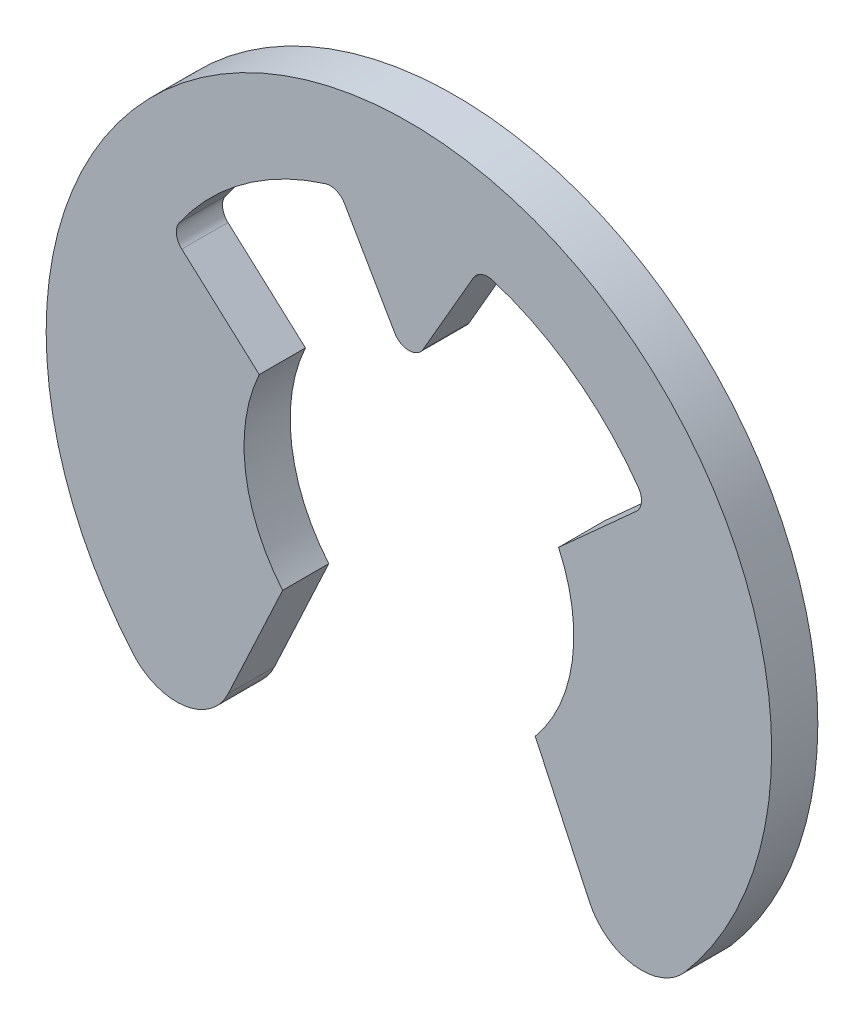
ISO-10303-21;
HEADER;
FILE_DESCRIPTION(('STEP AP214'),'2;1');
FILE_NAME('part.step','',(''),(''),'','','');
FILE_SCHEMA(('AUTOMOTIVE_DESIGN { 1 0 10303 214 1 1 1 1 }'));
ENDSEC;
DATA;
#1=APPLICATION_CONTEXT('core data for automotive mechanical design processes');
#2=APPLICATION_PROTOCOL_DEFINITION('international standard','automotive_design',2000,#1);
#3=PRODUCT_CONTEXT('',#1,'mechanical');
#4=PRODUCT('Part','Part','',(#3));
#5=PRODUCT_RELATED_PRODUCT_CATEGORY('part','',(#4));
#6=PRODUCT_DEFINITION_FORMATION('','',#4);
#7=PRODUCT_DEFINITION_CONTEXT('part definition',#1,'design');
#8=PRODUCT_DEFINITION('design','',#6,#7);
#9=PRODUCT_DEFINITION_SHAPE('','',#8);
#10=(LENGTH_UNIT() NAMED_UNIT(*) SI_UNIT(.MILLI.,.METRE.));
#11=(NAMED_UNIT(*) PLANE_ANGLE_UNIT() SI_UNIT($,.RADIAN.));
#12=(NAMED_UNIT(*) SI_UNIT($,.STERADIAN.) SOLID_ANGLE_UNIT());
#13=UNCERTAINTY_MEASURE_WITH_UNIT(LENGTH_MEASURE(1.E-05),#10,'distance_accuracy_value','');
#14=(GEOMETRIC_REPRESENTATION_CONTEXT(3) GLOBAL_UNCERTAINTY_ASSIGNED_CONTEXT((#13)) GLOBAL_UNIT_ASSIGNED_CONTEXT((#10,
#11,#12)) REPRESENTATION_CONTEXT('',''));
#15=CARTESIAN_POINT('',(0.,0.,0.));
#16=DIRECTION('',(0.,0.,1.));
#17=DIRECTION('',(1.,0.,0.));
#18=AXIS2_PLACEMENT_3D('',#15,#16,#17);
#19=CARTESIAN_POINT('',(1.19378964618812,3.81770432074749,0.7));
#20=DIRECTION('',(0.,0.,1.));
#21=DIRECTION('',(1.,0.,0.));
#22=AXIS2_PLACEMENT_3D('',#19,#20,#21);
#23=PLANE('',#22);
#24=CARTESIAN_POINT('',(0.,2.75,0.7));
#25=DIRECTION('',(0.,0.,-1.));
#26=DIRECTION('',(-1.,0.,0.));
#27=AXIS2_PLACEMENT_3D('',#24,#25,#26);
#28=CIRCLE('',#27,0.25);
#29=CARTESIAN_POINT('',(-0.216506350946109,2.625,0.7));
#30=VERTEX_POINT('',#29);
#31=CARTESIAN_POINT('',(0.216506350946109,2.625,0.7));
#32=VERTEX_POINT('',#31);
#33=EDGE_CURVE('E141',#30,#32,#28,.F.);
#34=ORIENTED_EDGE('',*,*,#33,.T.);
#35=DIRECTION('',(0.500000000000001,0.866025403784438,0.));
#36=VECTOR('',#35,1.);
#37=CARTESIAN_POINT('',(0.216506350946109,2.625,0.7));
#38=LINE('',#37,#36);
#39=CARTESIAN_POINT('',(0.977283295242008,3.94270432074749,0.7));
#40=VERTEX_POINT('',#39);
#41=EDGE_CURVE('E138',#32,#40,#38,.T.);
#42=ORIENTED_EDGE('',*,*,#41,.T.);
#43=CARTESIAN_POINT('',(1.19378964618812,3.81770432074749,0.7));
#44=DIRECTION('',(0.,0.,-1.));
#45=DIRECTION('',(-1.,0.,0.));
#46=AXIS2_PLACEMENT_3D('',#43,#44,#45);
#47=CIRCLE('',#46,0.250000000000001);
#48=CARTESIAN_POINT('',(1.26840149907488,4.05631084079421,0.7));
#49=VERTEX_POINT('',#48);
#50=EDGE_CURVE('E19',#40,#49,#47,.T.);
#51=ORIENTED_EDGE('',*,*,#50,.T.);
#52=CARTESIAN_POINT('',(0.,0.,0.7));
#53=DIRECTION('',(0.,0.,-1.));
#54=DIRECTION('',(-1.,0.,0.));
#55=AXIS2_PLACEMENT_3D('',#52,#53,#54);
#56=CIRCLE('',#55,4.25);
#57=CARTESIAN_POINT('',(3.4810551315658,2.43818686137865,0.7));
#58=VERTEX_POINT('',#57);
#59=EDGE_CURVE('E144',#49,#58,#56,.T.);
#60=ORIENTED_EDGE('',*,*,#59,.T.);
#61=CARTESIAN_POINT('',(3.27628718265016,2.29476410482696,0.7));
#62=DIRECTION('',(0.,0.,-1.));
#63=DIRECTION('',(-1.,0.,0.));
#64=AXIS2_PLACEMENT_3D('',#61,#62,#63);
#65=CIRCLE('',#64,0.250000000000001);
#66=CARTESIAN_POINT('',(3.44367977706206,2.10907695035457,0.7));
#67=VERTEX_POINT('',#66);
#68=EDGE_CURVE('E164',#58,#67,#65,.T.);
#69=ORIENTED_EDGE('',*,*,#68,.T.);
#70=DIRECTION('',(0.742748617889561,0.669570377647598,0.));
#71=VECTOR('',#70,1.);
#72=CARTESIAN_POINT('',(3.44367977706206,2.10907695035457,0.7));
#73=LINE('',#72,#71);
#74=CARTESIAN_POINT('',(2.26882339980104,1.04997160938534,0.7));
#75=VERTEX_POINT('',#74);
#76=EDGE_CURVE('E228',#67,#75,#73,.F.);
#77=ORIENTED_EDGE('',*,*,#76,.T.);
#78=CARTESIAN_POINT('',(0.,0.,0.7));
#79=DIRECTION('',(0.,0.,-1.));
#80=DIRECTION('',(-1.,0.,0.));
#81=AXIS2_PLACEMENT_3D('',#78,#79,#80);
#82=CIRCLE('',#81,2.5);
#83=CARTESIAN_POINT('',(1.91511110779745,-1.60696902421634,0.7));
#84=VERTEX_POINT('',#83);
#85=EDGE_CURVE('E167',#75,#84,#82,.T.);
#86=ORIENTED_EDGE('',*,*,#85,.T.);
#87=DIRECTION('',(-0.422618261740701,0.906307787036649,0.));
#88=VECTOR('',#87,1.);
#89=CARTESIAN_POINT('',(1.91511110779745,-1.60696902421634,0.7));
#90=LINE('',#89,#88);
#91=CARTESIAN_POINT('',(2.73972895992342,-3.37536771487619,0.7));
#92=VERTEX_POINT('',#91);
#93=EDGE_CURVE('E174',#84,#92,#90,.F.);
#94=ORIENTED_EDGE('',*,*,#93,.T.);
#95=CARTESIAN_POINT('',(3.52423493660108,-3.00954657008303,0.7));
#96=DIRECTION('',(0.,0.,-1.));
#97=DIRECTION('',(-1.,0.,0.));
#98=AXIS2_PLACEMENT_3D('',#95,#96,#97);
#99=CIRCLE('',#98,0.865606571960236);
#100=CARTESIAN_POINT('',(4.18248740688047,-3.57166615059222,0.7));
#101=VERTEX_POINT('',#100);
#102=EDGE_CURVE('E171',#101,#92,#99,.T.);
#103=ORIENTED_EDGE('',*,*,#102,.F.);
#104=CARTESIAN_POINT('',(0.,0.,0.7));
#105=DIRECTION('',(0.,0.,-1.));
#106=DIRECTION('',(-1.,0.,0.));
#107=AXIS2_PLACEMENT_3D('',#104,#105,#106);
#108=CIRCLE('',#107,5.5);
#109=CARTESIAN_POINT('',(-4.18248740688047,-3.57166615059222,0.7));
#110=VERTEX_POINT('',#109);
#111=EDGE_CURVE('E175',#110,#101,#108,.T.);
#112=ORIENTED_EDGE('',*,*,#111,.F.);
#113=CARTESIAN_POINT('',(-3.52423493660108,-3.00954657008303,0.7));
#114=DIRECTION('',(0.,0.,-1.));
#115=DIRECTION('',(-1.,0.,0.));
#116=AXIS2_PLACEMENT_3D('',#113,#114,#115);
#117=CIRCLE('',#116,0.865606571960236);
#118=CARTESIAN_POINT('',(-2.73972895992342,-3.37536771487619,0.7));
#119=VERTEX_POINT('',#118);
#120=EDGE_CURVE('E177',#119,#110,#117,.T.);
#121=ORIENTED_EDGE('',*,*,#120,.F.);
#122=DIRECTION('',(0.422618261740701,0.906307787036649,0.));
#123=VECTOR('',#122,1.);
#124=CARTESIAN_POINT('',(-1.91511110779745,-1.60696902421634,0.7));
#125=LINE('',#124,#123);
#126=CARTESIAN_POINT('',(-1.91511110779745,-1.60696902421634,0.7));
#127=VERTEX_POINT('',#126);
#128=EDGE_CURVE('E232',#127,#119,#125,.F.);
#129=ORIENTED_EDGE('',*,*,#128,.F.);
#130=CARTESIAN_POINT('',(0.,0.,0.7));
#131=DIRECTION('',(0.,0.,-1.));
#132=DIRECTION('',(-1.,0.,0.));
#133=AXIS2_PLACEMENT_3D('',#130,#131,#132);
#134=CIRCLE('',#133,2.5);
#135=CARTESIAN_POINT('',(-2.26882339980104,1.04997160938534,0.7));
#136=VERTEX_POINT('',#135);
#137=EDGE_CURVE('E181',#127,#136,#134,.T.);
#138=ORIENTED_EDGE('',*,*,#137,.T.);
#139=DIRECTION('',(-0.742748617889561,0.669570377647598,0.));
#140=VECTOR('',#139,1.);
#141=CARTESIAN_POINT('',(-3.44367977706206,2.10907695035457,0.7));
#142=LINE('',#141,#140);
#143=CARTESIAN_POINT('',(-3.44367977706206,2.10907695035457,0.7));
#144=VERTEX_POINT('',#143);
#145=EDGE_CURVE('E184',#144,#136,#142,.F.);
#146=ORIENTED_EDGE('',*,*,#145,.F.);
#147=CARTESIAN_POINT('',(-3.27628718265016,2.29476410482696,0.7));
#148=DIRECTION('',(0.,0.,-1.));
#149=DIRECTION('',(-1.,0.,0.));
#150=AXIS2_PLACEMENT_3D('',#147,#148,#149);
#151=CIRCLE('',#150,0.250000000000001);
#152=CARTESIAN_POINT('',(-3.4810551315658,2.43818686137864,0.7));
#153=VERTEX_POINT('',#152);
#154=EDGE_CURVE('E186',#144,#153,#151,.T.);
#155=ORIENTED_EDGE('',*,*,#154,.T.);
#156=CARTESIAN_POINT('',(0.,0.,0.7));
#157=DIRECTION('',(0.,0.,-1.));
#158=DIRECTION('',(-1.,0.,0.));
#159=AXIS2_PLACEMENT_3D('',#156,#157,#158);
#160=CIRCLE('',#159,4.25);
#161=CARTESIAN_POINT('',(-1.26840149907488,4.05631084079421,0.7));
#162=VERTEX_POINT('',#161);
#163=EDGE_CURVE('E190',#153,#162,#160,.T.);
#164=ORIENTED_EDGE('',*,*,#163,.T.);
#165=CARTESIAN_POINT('',(-1.19378964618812,3.81770432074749,0.7));
#166=DIRECTION('',(0.,0.,-1.));
#167=DIRECTION('',(-1.,0.,0.));
#168=AXIS2_PLACEMENT_3D('',#165,#166,#167);
#169=CIRCLE('',#168,0.250000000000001);
#170=CARTESIAN_POINT('',(-0.977283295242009,3.94270432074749,0.7));
#171=VERTEX_POINT('',#170);
#172=EDGE_CURVE('E155',#162,#171,#169,.T.);
#173=ORIENTED_EDGE('',*,*,#172,.T.);
#174=DIRECTION('',(0.500000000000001,-0.866025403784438,0.));
#175=VECTOR('',#174,1.);
#176=CARTESIAN_POINT('',(-0.977283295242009,3.94270432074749,0.7));
#177=LINE('',#176,#175);
#178=EDGE_CURVE('E156',#171,#30,#177,.T.);
#179=ORIENTED_EDGE('',*,*,#178,.T.);
#180=EDGE_LOOP('',(#34,#42,#51,#60,#69,#77,#86,#94,#103,#112,#121,#129,#138,#146,#155,#164,#173,#179));
#181=FACE_BOUND('',#180,.T.);
#182=ADVANCED_FACE('F15',(#181),#23,.T.);
#183=CARTESIAN_POINT('',(0.,0.,0.7));
#184=DIRECTION('',(0.,0.,-1.));
#185=DIRECTION('',(-1.,0.,0.));
#186=AXIS2_PLACEMENT_3D('',#183,#184,#185);
#187=CYLINDRICAL_SURFACE('',#186,4.25);
#188=DIRECTION('',(0.,0.,-1.));
#189=VECTOR('',#188,1.);
#190=CARTESIAN_POINT('',(3.4810551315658,2.43818686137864,0.7));
#191=LINE('',#190,#189);
#192=CARTESIAN_POINT('',(3.4810551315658,2.43818686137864,0.));
#193=VERTEX_POINT('',#192);
#194=EDGE_CURVE('E163',#193,#58,#191,.F.);
#195=ORIENTED_EDGE('',*,*,#194,.T.);
#196=ORIENTED_EDGE('',*,*,#59,.F.);
#197=DIRECTION('',(0.,0.,-1.));
#198=VECTOR('',#197,1.);
#199=CARTESIAN_POINT('',(1.26840149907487,4.05631084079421,0.7));
#200=LINE('',#199,#198);
#201=CARTESIAN_POINT('',(1.26840149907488,4.05631084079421,0.));
#202=VERTEX_POINT('',#201);
#203=EDGE_CURVE('E149',#49,#202,#200,.T.);
#204=ORIENTED_EDGE('',*,*,#203,.T.);
#205=CARTESIAN_POINT('',(0.,0.,0.));
#206=DIRECTION('',(0.,0.,-1.));
#207=DIRECTION('',(-1.,0.,0.));
#208=AXIS2_PLACEMENT_3D('',#205,#206,#207);
#209=CIRCLE('',#208,4.25);
#210=EDGE_CURVE('E193',#202,#193,#209,.T.);
#211=ORIENTED_EDGE('',*,*,#210,.T.);
#212=EDGE_LOOP('',(#195,#196,#204,#211));
#213=FACE_BOUND('',#212,.T.);
#214=ADVANCED_FACE('F337',(#213),#187,.F.);
#215=CARTESIAN_POINT('',(3.27628718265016,2.29476410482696,0.7));
#216=DIRECTION('',(0.,0.,-1.));
#217=DIRECTION('',(-1.,0.,0.));
#218=AXIS2_PLACEMENT_3D('',#215,#216,#217);
#219=CYLINDRICAL_SURFACE('',#218,0.250000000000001);
#220=DIRECTION('',(0.,0.,1.));
#221=VECTOR('',#220,1.);
#222=CARTESIAN_POINT('',(3.44367977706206,2.10907695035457,0.7));
#223=LINE('',#222,#221);
#224=CARTESIAN_POINT('',(3.44367977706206,2.10907695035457,0.));
#225=VERTEX_POINT('',#224);
#226=EDGE_CURVE('E166',#225,#67,#223,.T.);
#227=ORIENTED_EDGE('',*,*,#226,.T.);
#228=ORIENTED_EDGE('',*,*,#68,.F.);
#229=ORIENTED_EDGE('',*,*,#194,.F.);
#230=CARTESIAN_POINT('',(3.27628718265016,2.29476410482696,0.));
#231=DIRECTION('',(0.,0.,-1.));
#232=DIRECTION('',(-1.,0.,0.));
#233=AXIS2_PLACEMENT_3D('',#230,#231,#232);
#234=CIRCLE('',#233,0.250000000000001);
#235=EDGE_CURVE('E196',#193,#225,#234,.T.);
#236=ORIENTED_EDGE('',*,*,#235,.T.);
#237=EDGE_LOOP('',(#227,#228,#229,#236));
#238=FACE_BOUND('',#237,.T.);
#239=ADVANCED_FACE('F334',(#238),#219,.F.);
#240=CARTESIAN_POINT('',(3.44367977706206,2.10907695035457,0.7));
#241=DIRECTION('',(0.669570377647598,-0.742748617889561,0.));
#242=DIRECTION('',(0.742748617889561,0.669570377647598,0.));
#243=AXIS2_PLACEMENT_3D('',#240,#241,#242);
#244=PLANE('',#243);
#245=DIRECTION('',(0.,0.,-1.));
#246=VECTOR('',#245,1.);
#247=CARTESIAN_POINT('',(2.26882339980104,1.04997160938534,0.7));
#248=LINE('',#247,#246);
#249=CARTESIAN_POINT('',(2.26882339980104,1.04997160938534,0.));
#250=VERTEX_POINT('',#249);
#251=EDGE_CURVE('E170',#250,#75,#248,.F.);
#252=ORIENTED_EDGE('',*,*,#251,.T.);
#253=ORIENTED_EDGE('',*,*,#76,.F.);
#254=ORIENTED_EDGE('',*,*,#226,.F.);
#255=DIRECTION('',(-0.74274861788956,-0.669570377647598,0.));
#256=VECTOR('',#255,1.);
#257=CARTESIAN_POINT('',(3.44367977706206,2.10907695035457,0.));
#258=LINE('',#257,#256);
#259=EDGE_CURVE('E199',#225,#250,#258,.T.);
#260=ORIENTED_EDGE('',*,*,#259,.T.);
#261=EDGE_LOOP('',(#252,#253,#254,#260));
#262=FACE_BOUND('',#261,.T.);
#263=ADVANCED_FACE('F331',(#262),#244,.F.);
#264=CARTESIAN_POINT('',(0.,0.,0.7));
#265=DIRECTION('',(0.,0.,-1.));
#266=DIRECTION('',(-1.,0.,0.));
#267=AXIS2_PLACEMENT_3D('',#264,#265,#266);
#268=CYLINDRICAL_SURFACE('',#267,2.5);
#269=DIRECTION('',(0.,0.,1.));
#270=VECTOR('',#269,1.);
#271=CARTESIAN_POINT('',(1.91511110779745,-1.60696902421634,0.7));
#272=LINE('',#271,#270);
#273=CARTESIAN_POINT('',(1.91511110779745,-1.60696902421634,0.));
#274=VERTEX_POINT('',#273);
#275=EDGE_CURVE('E169',#274,#84,#272,.T.);
#276=ORIENTED_EDGE('',*,*,#275,.T.);
#277=ORIENTED_EDGE('',*,*,#85,.F.);
#278=ORIENTED_EDGE('',*,*,#251,.F.);
#279=CARTESIAN_POINT('',(0.,0.,0.));
#280=DIRECTION('',(0.,0.,-1.));
#281=DIRECTION('',(-1.,0.,0.));
#282=AXIS2_PLACEMENT_3D('',#279,#280,#281);
#283=CIRCLE('',#282,2.5);
#284=EDGE_CURVE('E200',#250,#274,#283,.T.);
#285=ORIENTED_EDGE('',*,*,#284,.T.);
#286=EDGE_LOOP('',(#276,#277,#278,#285));
#287=FACE_BOUND('',#286,.T.);
#288=ADVANCED_FACE('F327',(#287),#268,.F.);
#289=CARTESIAN_POINT('',(1.91511110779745,-1.60696902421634,0.7));
#290=DIRECTION('',(0.906307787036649,0.422618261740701,0.));
#291=DIRECTION('',(-0.422618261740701,0.906307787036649,0.));
#292=AXIS2_PLACEMENT_3D('',#289,#290,#291);
#293=PLANE('',#292);
#294=DIRECTION('',(0.,0.,-1.));
#295=VECTOR('',#294,1.);
#296=CARTESIAN_POINT('',(2.73972895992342,-3.37536771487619,0.7));
#297=LINE('',#296,#295);
#298=CARTESIAN_POINT('',(2.73972895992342,-3.37536771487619,0.));
#299=VERTEX_POINT('',#298);
#300=EDGE_CURVE('E173',#92,#299,#297,.T.);
#301=ORIENTED_EDGE('',*,*,#300,.F.);
#302=ORIENTED_EDGE('',*,*,#93,.F.);
#303=ORIENTED_EDGE('',*,*,#275,.F.);
#304=DIRECTION('',(0.422618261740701,-0.906307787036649,0.));
#305=VECTOR('',#304,1.);
#306=CARTESIAN_POINT('',(1.91511110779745,-1.60696902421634,0.));
#307=LINE('',#306,#305);
#308=EDGE_CURVE('E203',#274,#299,#307,.T.);
#309=ORIENTED_EDGE('',*,*,#308,.T.);
#310=EDGE_LOOP('',(#301,#302,#303,#309));
#311=FACE_BOUND('',#310,.T.);
#312=ADVANCED_FACE('F323',(#311),#293,.F.);
#313=CARTESIAN_POINT('',(3.52423493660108,-3.00954657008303,0.7));
#314=DIRECTION('',(0.,0.,-1.));
#315=DIRECTION('',(-1.,0.,0.));
#316=AXIS2_PLACEMENT_3D('',#313,#314,#315);
#317=CYLINDRICAL_SURFACE('',#316,0.865606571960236);
#318=ORIENTED_EDGE('',*,*,#102,.T.);
#319=ORIENTED_EDGE('',*,*,#300,.T.);
#320=CARTESIAN_POINT('',(3.52423493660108,-3.00954657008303,0.));
#321=DIRECTION('',(0.,0.,-1.));
#322=DIRECTION('',(-1.,0.,0.));
#323=AXIS2_PLACEMENT_3D('',#320,#321,#322);
#324=CIRCLE('',#323,0.865606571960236);
#325=CARTESIAN_POINT('',(4.18248740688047,-3.57166615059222,0.));
#326=VERTEX_POINT('',#325);
#327=EDGE_CURVE('E204',#299,#326,#324,.F.);
#328=ORIENTED_EDGE('',*,*,#327,.T.);
#329=DIRECTION('',(0.,0.,-1.));
#330=VECTOR('',#329,1.);
#331=CARTESIAN_POINT('',(4.18248740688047,-3.57166615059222,0.7));
#332=LINE('',#331,#330);
#333=EDGE_CURVE('E178',#101,#326,#332,.T.);
#334=ORIENTED_EDGE('',*,*,#333,.F.);
#335=EDGE_LOOP('',(#318,#319,#328,#334));
#336=FACE_BOUND('',#335,.T.);
#337=ADVANCED_FACE('F318',(#336),#317,.T.);
#338=CARTESIAN_POINT('',(0.,0.,0.7));
#339=DIRECTION('',(0.,0.,-1.));
#340=DIRECTION('',(-1.,0.,0.));
#341=AXIS2_PLACEMENT_3D('',#338,#339,#340);
#342=CYLINDRICAL_SURFACE('',#341,5.5);
#343=CARTESIAN_POINT('',(0.,0.,0.));
#344=DIRECTION('',(0.,0.,-1.));
#345=DIRECTION('',(-1.,0.,0.));
#346=AXIS2_PLACEMENT_3D('',#343,#344,#345);
#347=CIRCLE('',#346,5.5);
#348=CARTESIAN_POINT('',(-4.18248740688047,-3.57166615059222,0.));
#349=VERTEX_POINT('',#348);
#350=EDGE_CURVE('E207',#326,#349,#347,.F.);
#351=ORIENTED_EDGE('',*,*,#350,.T.);
#352=DIRECTION('',(0.,0.,-1.));
#353=VECTOR('',#352,1.);
#354=CARTESIAN_POINT('',(-4.18248740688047,-3.57166615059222,0.7));
#355=LINE('',#354,#353);
#356=EDGE_CURVE('E180',#110,#349,#355,.T.);
#357=ORIENTED_EDGE('',*,*,#356,.F.);
#358=ORIENTED_EDGE('',*,*,#111,.T.);
#359=ORIENTED_EDGE('',*,*,#333,.T.);
#360=EDGE_LOOP('',(#351,#357,#358,#359));
#361=FACE_BOUND('',#360,.T.);
#362=ADVANCED_FACE('F416',(#361),#342,.T.);
#363=CARTESIAN_POINT('',(-3.52423493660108,-3.00954657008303,0.7));
#364=DIRECTION('',(0.,0.,-1.));
#365=DIRECTION('',(-1.,0.,0.));
#366=AXIS2_PLACEMENT_3D('',#363,#364,#365);
#367=CYLINDRICAL_SURFACE('',#366,0.865606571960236);
#368=ORIENTED_EDGE('',*,*,#120,.T.);
#369=ORIENTED_EDGE('',*,*,#356,.T.);
#370=CARTESIAN_POINT('',(-3.52423493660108,-3.00954657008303,0.));
#371=DIRECTION('',(0.,0.,-1.));
#372=DIRECTION('',(-1.,0.,0.));
#373=AXIS2_PLACEMENT_3D('',#370,#371,#372);
#374=CIRCLE('',#373,0.865606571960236);
#375=CARTESIAN_POINT('',(-2.73972895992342,-3.37536771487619,0.));
#376=VERTEX_POINT('',#375);
#377=EDGE_CURVE('E209',#349,#376,#374,.F.);
#378=ORIENTED_EDGE('',*,*,#377,.T.);
#379=DIRECTION('',(0.,0.,1.));
#380=VECTOR('',#379,1.);
#381=CARTESIAN_POINT('',(-2.73972895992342,-3.37536771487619,0.7));
#382=LINE('',#381,#380);
#383=EDGE_CURVE('E234',#119,#376,#382,.F.);
#384=ORIENTED_EDGE('',*,*,#383,.F.);
#385=EDGE_LOOP('',(#368,#369,#378,#384));
#386=FACE_BOUND('',#385,.T.);
#387=ADVANCED_FACE('F309',(#386),#367,.T.);
#388=CARTESIAN_POINT('',(-1.91511110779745,-1.60696902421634,0.7));
#389=DIRECTION('',(0.906307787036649,-0.422618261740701,0.));
#390=DIRECTION('',(0.422618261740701,0.906307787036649,0.));
#391=AXIS2_PLACEMENT_3D('',#388,#389,#390);
#392=PLANE('',#391);
#393=ORIENTED_EDGE('',*,*,#128,.T.);
#394=ORIENTED_EDGE('',*,*,#383,.T.);
#395=DIRECTION('',(0.422618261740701,0.906307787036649,0.));
#396=VECTOR('',#395,1.);
#397=CARTESIAN_POINT('',(-2.73972895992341,-3.37536771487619,0.));
#398=LINE('',#397,#396);
#399=CARTESIAN_POINT('',(-1.91511110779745,-1.60696902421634,0.));
#400=VERTEX_POINT('',#399);
#401=EDGE_CURVE('E212',#376,#400,#398,.T.);
#402=ORIENTED_EDGE('',*,*,#401,.T.);
#403=DIRECTION('',(0.,0.,-1.));
#404=VECTOR('',#403,1.);
#405=CARTESIAN_POINT('',(-1.91511110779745,-1.60696902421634,0.7));
#406=LINE('',#405,#404);
#407=EDGE_CURVE('E185',#400,#127,#406,.F.);
#408=ORIENTED_EDGE('',*,*,#407,.T.);
#409=EDGE_LOOP('',(#393,#394,#402,#408));
#410=FACE_BOUND('',#409,.T.);
#411=ADVANCED_FACE('F305',(#410),#392,.T.);
#412=CARTESIAN_POINT('',(0.,0.,0.7));
#413=DIRECTION('',(0.,0.,-1.));
#414=DIRECTION('',(-1.,0.,0.));
#415=AXIS2_PLACEMENT_3D('',#412,#413,#414);
#416=CYLINDRICAL_SURFACE('',#415,2.5);
#417=ORIENTED_EDGE('',*,*,#137,.F.);
#418=ORIENTED_EDGE('',*,*,#407,.F.);
#419=CARTESIAN_POINT('',(0.,0.,0.));
#420=DIRECTION('',(0.,0.,-1.));
#421=DIRECTION('',(-1.,0.,0.));
#422=AXIS2_PLACEMENT_3D('',#419,#420,#421);
#423=CIRCLE('',#422,2.5);
#424=CARTESIAN_POINT('',(-2.26882339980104,1.04997160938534,0.));
#425=VERTEX_POINT('',#424);
#426=EDGE_CURVE('E213',#400,#425,#423,.T.);
#427=ORIENTED_EDGE('',*,*,#426,.T.);
#428=DIRECTION('',(0.,0.,1.));
#429=VECTOR('',#428,1.);
#430=CARTESIAN_POINT('',(-2.26882339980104,1.04997160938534,0.7));
#431=LINE('',#430,#429);
#432=EDGE_CURVE('E236',#136,#425,#431,.F.);
#433=ORIENTED_EDGE('',*,*,#432,.F.);
#434=EDGE_LOOP('',(#417,#418,#427,#433));
#435=FACE_BOUND('',#434,.T.);
#436=ADVANCED_FACE('F300',(#435),#416,.F.);
#437=CARTESIAN_POINT('',(-3.44367977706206,2.10907695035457,0.7));
#438=DIRECTION('',(0.669570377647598,0.742748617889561,0.));
#439=DIRECTION('',(-0.742748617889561,0.669570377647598,0.));
#440=AXIS2_PLACEMENT_3D('',#437,#438,#439);
#441=PLANE('',#440);
#442=ORIENTED_EDGE('',*,*,#145,.T.);
#443=ORIENTED_EDGE('',*,*,#432,.T.);
#444=DIRECTION('',(-0.74274861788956,0.669570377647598,0.));
#445=VECTOR('',#444,1.);
#446=CARTESIAN_POINT('',(-2.26882339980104,1.04997160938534,0.));
#447=LINE('',#446,#445);
#448=CARTESIAN_POINT('',(-3.44367977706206,2.10907695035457,0.));
#449=VERTEX_POINT('',#448);
#450=EDGE_CURVE('E215',#425,#449,#447,.T.);
#451=ORIENTED_EDGE('',*,*,#450,.T.);
#452=DIRECTION('',(0.,0.,-1.));
#453=VECTOR('',#452,1.);
#454=CARTESIAN_POINT('',(-3.44367977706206,2.10907695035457,0.7));
#455=LINE('',#454,#453);
#456=EDGE_CURVE('E189',#449,#144,#455,.F.);
#457=ORIENTED_EDGE('',*,*,#456,.T.);
#458=EDGE_LOOP('',(#442,#443,#451,#457));
#459=FACE_BOUND('',#458,.T.);
#460=ADVANCED_FACE('F296',(#459),#441,.T.);
#461=CARTESIAN_POINT('',(-3.27628718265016,2.29476410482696,0.7));
#462=DIRECTION('',(0.,0.,-1.));
#463=DIRECTION('',(-1.,0.,0.));
#464=AXIS2_PLACEMENT_3D('',#461,#462,#463);
#465=CYLINDRICAL_SURFACE('',#464,0.250000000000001);
#466=ORIENTED_EDGE('',*,*,#154,.F.);
#467=ORIENTED_EDGE('',*,*,#456,.F.);
#468=CARTESIAN_POINT('',(-3.27628718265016,2.29476410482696,0.));
#469=DIRECTION('',(0.,0.,-1.));
#470=DIRECTION('',(-1.,0.,0.));
#471=AXIS2_PLACEMENT_3D('',#468,#469,#470);
#472=CIRCLE('',#471,0.250000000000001);
#473=CARTESIAN_POINT('',(-3.4810551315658,2.43818686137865,0.));
#474=VERTEX_POINT('',#473);
#475=EDGE_CURVE('E216',#449,#474,#472,.T.);
#476=ORIENTED_EDGE('',*,*,#475,.T.);
#477=DIRECTION('',(0.,0.,-1.));
#478=VECTOR('',#477,1.);
#479=CARTESIAN_POINT('',(-3.4810551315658,2.43818686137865,0.7));
#480=LINE('',#479,#478);
#481=EDGE_CURVE('E188',#474,#153,#480,.F.);
#482=ORIENTED_EDGE('',*,*,#481,.T.);
#483=EDGE_LOOP('',(#466,#467,#476,#482));
#484=FACE_BOUND('',#483,.T.);
#485=ADVANCED_FACE('F385',(#484),#465,.F.);
#486=CARTESIAN_POINT('',(0.,0.,0.7));
#487=DIRECTION('',(0.,0.,-1.));
#488=DIRECTION('',(-1.,0.,0.));
#489=AXIS2_PLACEMENT_3D('',#486,#487,#488);
#490=CYLINDRICAL_SURFACE('',#489,4.25);
#491=DIRECTION('',(0.,0.,-1.));
#492=VECTOR('',#491,1.);
#493=CARTESIAN_POINT('',(-1.26840149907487,4.05631084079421,0.7));
#494=LINE('',#493,#492);
#495=CARTESIAN_POINT('',(-1.26840149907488,4.05631084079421,0.));
#496=VERTEX_POINT('',#495);
#497=EDGE_CURVE('E192',#496,#162,#494,.F.);
#498=ORIENTED_EDGE('',*,*,#497,.T.);
#499=ORIENTED_EDGE('',*,*,#163,.F.);
#500=ORIENTED_EDGE('',*,*,#481,.F.);
#501=CARTESIAN_POINT('',(0.,0.,0.));
#502=DIRECTION('',(0.,0.,-1.));
#503=DIRECTION('',(-1.,0.,0.));
#504=AXIS2_PLACEMENT_3D('',#501,#502,#503);
#505=CIRCLE('',#504,4.25);
#506=EDGE_CURVE('E218',#474,#496,#505,.T.);
#507=ORIENTED_EDGE('',*,*,#506,.T.);
#508=EDGE_LOOP('',(#498,#499,#500,#507));
#509=FACE_BOUND('',#508,.T.);
#510=ADVANCED_FACE('F289',(#509),#490,.F.);
#511=CARTESIAN_POINT('',(-1.19378964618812,3.81770432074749,0.7));
#512=DIRECTION('',(0.,0.,-1.));
#513=DIRECTION('',(-1.,0.,0.));
#514=AXIS2_PLACEMENT_3D('',#511,#512,#513);
#515=CYLINDRICAL_SURFACE('',#514,0.250000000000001);
#516=DIRECTION('',(0.,0.,1.));
#517=VECTOR('',#516,1.);
#518=CARTESIAN_POINT('',(-0.977283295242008,3.94270432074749,0.7));
#519=LINE('',#518,#517);
#520=CARTESIAN_POINT('',(-0.977283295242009,3.94270432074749,0.));
#521=VERTEX_POINT('',#520);
#522=EDGE_CURVE('E260',#171,#521,#519,.F.);
#523=ORIENTED_EDGE('',*,*,#522,.F.);
#524=ORIENTED_EDGE('',*,*,#172,.F.);
#525=ORIENTED_EDGE('',*,*,#497,.F.);
#526=CARTESIAN_POINT('',(-1.19378964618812,3.81770432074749,0.));
#527=DIRECTION('',(0.,0.,-1.));
#528=DIRECTION('',(-1.,0.,0.));
#529=AXIS2_PLACEMENT_3D('',#526,#527,#528);
#530=CIRCLE('',#529,0.250000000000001);
#531=EDGE_CURVE('E221',#496,#521,#530,.T.);
#532=ORIENTED_EDGE('',*,*,#531,.T.);
#533=EDGE_LOOP('',(#523,#524,#525,#532));
#534=FACE_BOUND('',#533,.T.);
#535=ADVANCED_FACE('F286',(#534),#515,.F.);
#536=CARTESIAN_POINT('',(-0.216506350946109,2.625,0.7));
#537=DIRECTION('',(-0.866025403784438,-0.500000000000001,0.));
#538=DIRECTION('',(0.500000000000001,-0.866025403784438,0.));
#539=AXIS2_PLACEMENT_3D('',#536,#537,#538);
#540=PLANE('',#539);
#541=ORIENTED_EDGE('',*,*,#178,.F.);
#542=ORIENTED_EDGE('',*,*,#522,.T.);
#543=DIRECTION('',(0.500000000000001,-0.866025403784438,0.));
#544=VECTOR('',#543,1.);
#545=CARTESIAN_POINT('',(-0.977283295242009,3.94270432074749,0.));
#546=LINE('',#545,#544);
#547=CARTESIAN_POINT('',(-0.216506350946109,2.625,0.));
#548=VERTEX_POINT('',#547);
#549=EDGE_CURVE('E224',#521,#548,#546,.T.);
#550=ORIENTED_EDGE('',*,*,#549,.T.);
#551=DIRECTION('',(0.,0.,-1.));
#552=VECTOR('',#551,1.);
#553=CARTESIAN_POINT('',(-0.21650635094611,2.625,0.7));
#554=LINE('',#553,#552);
#555=EDGE_CURVE('E262',#30,#548,#554,.T.);
#556=ORIENTED_EDGE('',*,*,#555,.F.);
#557=EDGE_LOOP('',(#541,#542,#550,#556));
#558=FACE_BOUND('',#557,.T.);
#559=ADVANCED_FACE('F280',(#558),#540,.T.);
#560=CARTESIAN_POINT('',(0.,2.75,0.7));
#561=DIRECTION('',(0.,0.,-1.));
#562=DIRECTION('',(-1.,0.,0.));
#563=AXIS2_PLACEMENT_3D('',#560,#561,#562);
#564=CYLINDRICAL_SURFACE('',#563,0.25);
#565=ORIENTED_EDGE('',*,*,#33,.F.);
#566=ORIENTED_EDGE('',*,*,#555,.T.);
#567=CARTESIAN_POINT('',(0.,2.75,0.));
#568=DIRECTION('',(0.,0.,-1.));
#569=DIRECTION('',(-1.,0.,0.));
#570=AXIS2_PLACEMENT_3D('',#567,#568,#569);
#571=CIRCLE('',#570,0.25);
#572=CARTESIAN_POINT('',(0.216506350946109,2.625,0.));
#573=VERTEX_POINT('',#572);
#574=EDGE_CURVE('E225',#548,#573,#571,.F.);
#575=ORIENTED_EDGE('',*,*,#574,.T.);
#576=DIRECTION('',(0.,0.,1.));
#577=VECTOR('',#576,1.);
#578=CARTESIAN_POINT('',(0.216506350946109,2.625,0.7));
#579=LINE('',#578,#577);
#580=EDGE_CURVE('E150',#573,#32,#579,.T.);
#581=ORIENTED_EDGE('',*,*,#580,.T.);
#582=EDGE_LOOP('',(#565,#566,#575,#581));
#583=FACE_BOUND('',#582,.T.);
#584=ADVANCED_FACE('F339',(#583),#564,.T.);
#585=CARTESIAN_POINT('',(0.216506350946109,2.625,0.7));
#586=DIRECTION('',(-0.866025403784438,0.500000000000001,0.));
#587=DIRECTION('',(-0.500000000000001,-0.866025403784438,0.));
#588=AXIS2_PLACEMENT_3D('',#585,#586,#587);
#589=PLANE('',#588);
#590=DIRECTION('',(0.,0.,-1.));
#591=VECTOR('',#590,1.);
#592=CARTESIAN_POINT('',(0.977283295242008,3.94270432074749,0.7));
#593=LINE('',#592,#591);
#594=CARTESIAN_POINT('',(0.977283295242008,3.94270432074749,0.));
#595=VERTEX_POINT('',#594);
#596=EDGE_CURVE('E33',#595,#40,#593,.F.);
#597=ORIENTED_EDGE('',*,*,#596,.T.);
#598=ORIENTED_EDGE('',*,*,#41,.F.);
#599=ORIENTED_EDGE('',*,*,#580,.F.);
#600=DIRECTION('',(0.500000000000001,0.866025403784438,0.));
#601=VECTOR('',#600,1.);
#602=CARTESIAN_POINT('',(0.216506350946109,2.625,0.));
#603=LINE('',#602,#601);
#604=EDGE_CURVE('E25',#573,#595,#603,.T.);
#605=ORIENTED_EDGE('',*,*,#604,.T.);
#606=EDGE_LOOP('',(#597,#598,#599,#605));
#607=FACE_BOUND('',#606,.T.);
#608=ADVANCED_FACE('F147',(#607),#589,.F.);
#609=CARTESIAN_POINT('',(1.19378964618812,3.81770432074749,0.7));
#610=DIRECTION('',(0.,0.,-1.));
#611=DIRECTION('',(-1.,0.,0.));
#612=AXIS2_PLACEMENT_3D('',#609,#610,#611);
#613=CYLINDRICAL_SURFACE('',#612,0.250000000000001);
#614=ORIENTED_EDGE('',*,*,#203,.F.);
#615=ORIENTED_EDGE('',*,*,#50,.F.);
#616=ORIENTED_EDGE('',*,*,#596,.F.);
#617=CARTESIAN_POINT('',(1.19378964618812,3.81770432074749,0.));
#618=DIRECTION('',(0.,0.,-1.));
#619=DIRECTION('',(-1.,0.,0.));
#620=AXIS2_PLACEMENT_3D('',#617,#618,#619);
#621=CIRCLE('',#620,0.250000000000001);
#622=EDGE_CURVE('E10',#595,#202,#621,.T.);
#623=ORIENTED_EDGE('',*,*,#622,.T.);
#624=EDGE_LOOP('',(#614,#615,#616,#623));
#625=FACE_BOUND('',#624,.T.);
#626=ADVANCED_FACE('F153',(#625),#613,.F.);
#627=CARTESIAN_POINT('',(1.19378964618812,3.81770432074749,0.));
#628=DIRECTION('',(0.,0.,1.));
#629=DIRECTION('',(1.,0.,0.));
#630=AXIS2_PLACEMENT_3D('',#627,#628,#629);
#631=PLANE('',#630);
#632=ORIENTED_EDGE('',*,*,#604,.F.);
#633=ORIENTED_EDGE('',*,*,#574,.F.);
#634=ORIENTED_EDGE('',*,*,#549,.F.);
#635=ORIENTED_EDGE('',*,*,#531,.F.);
#636=ORIENTED_EDGE('',*,*,#506,.F.);
#637=ORIENTED_EDGE('',*,*,#475,.F.);
#638=ORIENTED_EDGE('',*,*,#450,.F.);
#639=ORIENTED_EDGE('',*,*,#426,.F.);
#640=ORIENTED_EDGE('',*,*,#401,.F.);
#641=ORIENTED_EDGE('',*,*,#377,.F.);
#642=ORIENTED_EDGE('',*,*,#350,.F.);
#643=ORIENTED_EDGE('',*,*,#327,.F.);
#644=ORIENTED_EDGE('',*,*,#308,.F.);
#645=ORIENTED_EDGE('',*,*,#284,.F.);
#646=ORIENTED_EDGE('',*,*,#259,.F.);
#647=ORIENTED_EDGE('',*,*,#235,.F.);
#648=ORIENTED_EDGE('',*,*,#210,.F.);
#649=ORIENTED_EDGE('',*,*,#622,.F.);
#650=EDGE_LOOP('',(#632,#633,#634,#635,#636,#637,#638,#639,#640,#641,#642,#643,#644,#645,#646,
#647,#648,#649));
#651=FACE_BOUND('',#650,.T.);
#652=ADVANCED_FACE('F17',(#651),#631,.F.);
#653=CLOSED_SHELL('',(#182,#214,#239,#263,#288,#312,#337,#362,#387,#411,#436,#460,#485,#510,
#535,#559,#584,#608,#626,#652));
#654=MANIFOLD_SOLID_BREP('B1',#653);
#655=ADVANCED_BREP_SHAPE_REPRESENTATION('',(#18,#654),#14);
#656=SHAPE_DEFINITION_REPRESENTATION(#9,#655);
ENDSEC;
END-ISO-10303-21;
